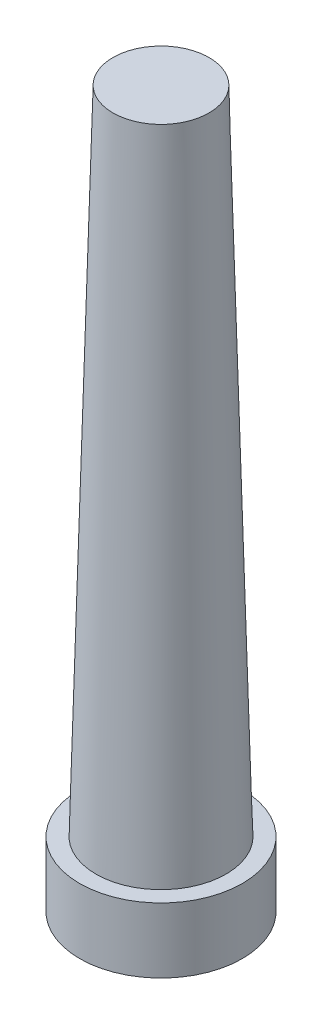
ISO-10303-21;
HEADER;
FILE_DESCRIPTION(('STEP AP214'),'2;1');
FILE_NAME('part.step','',(''),(''),'','','');
FILE_SCHEMA(('AUTOMOTIVE_DESIGN { 1 0 10303 214 1 1 1 1 }'));
ENDSEC;
DATA;
#1=APPLICATION_CONTEXT('core data for automotive mechanical design processes');
#2=APPLICATION_PROTOCOL_DEFINITION('international standard','automotive_design',2000,#1);
#3=PRODUCT_CONTEXT('',#1,'mechanical');
#4=PRODUCT('Part','Part','',(#3));
#5=PRODUCT_RELATED_PRODUCT_CATEGORY('part','',(#4));
#6=PRODUCT_DEFINITION_FORMATION('','',#4);
#7=PRODUCT_DEFINITION_CONTEXT('part definition',#1,'design');
#8=PRODUCT_DEFINITION('design','',#6,#7);
#9=PRODUCT_DEFINITION_SHAPE('','',#8);
#10=(LENGTH_UNIT() NAMED_UNIT(*) SI_UNIT(.MILLI.,.METRE.));
#11=(NAMED_UNIT(*) PLANE_ANGLE_UNIT() SI_UNIT($,.RADIAN.));
#12=(NAMED_UNIT(*) SI_UNIT($,.STERADIAN.) SOLID_ANGLE_UNIT());
#13=UNCERTAINTY_MEASURE_WITH_UNIT(LENGTH_MEASURE(1.E-05),#10,'distance_accuracy_value','');
#14=(GEOMETRIC_REPRESENTATION_CONTEXT(3) GLOBAL_UNCERTAINTY_ASSIGNED_CONTEXT((#13)) GLOBAL_UNIT_ASSIGNED_CONTEXT((#10,
#11,#12)) REPRESENTATION_CONTEXT('',''));
#15=CARTESIAN_POINT('',(0.,0.,0.));
#16=DIRECTION('',(0.,0.,1.));
#17=DIRECTION('',(1.,0.,0.));
#18=AXIS2_PLACEMENT_3D('',#15,#16,#17);
#19=CARTESIAN_POINT('',(0.,100.,0.));
#20=DIRECTION('',(0.,-1.,0.));
#21=DIRECTION('',(0.,0.,-1.));
#22=AXIS2_PLACEMENT_3D('',#19,#20,#21);
#23=CYLINDRICAL_SURFACE('',#22,125.);
#24=CARTESIAN_POINT('',(0.,100.,0.));
#25=DIRECTION('',(0.,1.,0.));
#26=DIRECTION('',(0.,0.,1.));
#27=AXIS2_PLACEMENT_3D('',#24,#25,#26);
#28=CIRCLE('',#27,125.);
#29=CARTESIAN_POINT('',(0.,100.,125.));
#30=VERTEX_POINT('',#29);
#31=EDGE_CURVE('E38',#30,#30,#28,.T.);
#32=ORIENTED_EDGE('',*,*,#31,.F.);
#33=EDGE_LOOP('',(#32));
#34=FACE_BOUND('',#33,.T.);
#35=CARTESIAN_POINT('',(0.,0.,0.));
#36=DIRECTION('',(0.,1.,0.));
#37=DIRECTION('',(0.,0.,1.));
#38=AXIS2_PLACEMENT_3D('',#35,#36,#37);
#39=CIRCLE('',#38,125.);
#40=CARTESIAN_POINT('',(0.,0.,125.));
#41=VERTEX_POINT('',#40);
#42=EDGE_CURVE('E34',#41,#41,#39,.T.);
#43=ORIENTED_EDGE('',*,*,#42,.T.);
#44=EDGE_LOOP('',(#43));
#45=FACE_BOUND('',#44,.T.);
#46=ADVANCED_FACE('F31',(#34,#45),#23,.T.);
#47=CARTESIAN_POINT('',(0.,100.,0.));
#48=DIRECTION('',(0.,1.,0.));
#49=DIRECTION('',(0.,0.,1.));
#50=AXIS2_PLACEMENT_3D('',#47,#48,#49);
#51=PLANE('',#50);
#52=CARTESIAN_POINT('',(0.,100.,0.));
#53=DIRECTION('',(0.,1.,0.));
#54=DIRECTION('',(0.,0.,1.));
#55=AXIS2_PLACEMENT_3D('',#52,#53,#54);
#56=CIRCLE('',#55,100.);
#57=CARTESIAN_POINT('',(0.,100.,100.));
#58=VERTEX_POINT('',#57);
#59=EDGE_CURVE('E10',#58,#58,#56,.T.);
#60=ORIENTED_EDGE('',*,*,#59,.F.);
#61=EDGE_LOOP('',(#60));
#62=FACE_BOUND('',#61,.T.);
#63=ORIENTED_EDGE('',*,*,#31,.T.);
#64=EDGE_LOOP('',(#63));
#65=FACE_BOUND('',#64,.T.);
#66=ADVANCED_FACE('F55',(#62,#65),#51,.T.);
#67=CARTESIAN_POINT('',(0.,0.,0.));
#68=DIRECTION('',(0.,1.,0.));
#69=DIRECTION('',(0.,0.,1.));
#70=AXIS2_PLACEMENT_3D('',#67,#68,#69);
#71=PLANE('',#70);
#72=ORIENTED_EDGE('',*,*,#42,.F.);
#73=EDGE_LOOP('',(#72));
#74=FACE_BOUND('',#73,.T.);
#75=ADVANCED_FACE('F52',(#74),#71,.F.);
#76=CARTESIAN_POINT('',(0.,100.,0.));
#77=DIRECTION('',(0.,-1.,0.));
#78=DIRECTION('',(0.,0.,1.));
#79=AXIS2_PLACEMENT_3D('',#76,#77,#78);
#80=CONICAL_SURFACE('',#79,100.,0.026179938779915);
#81=CARTESIAN_POINT('',(0.,1100.,0.));
#82=DIRECTION('',(0.,1.,0.));
#83=DIRECTION('',(0.,0.,1.));
#84=AXIS2_PLACEMENT_3D('',#81,#82,#83);
#85=CIRCLE('',#84,73.814078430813);
#86=CARTESIAN_POINT('',(0.,1100.,73.814078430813));
#87=VERTEX_POINT('',#86);
#88=EDGE_CURVE('E44',#87,#87,#85,.T.);
#89=ORIENTED_EDGE('',*,*,#88,.F.);
#90=EDGE_LOOP('',(#89));
#91=FACE_BOUND('',#90,.T.);
#92=ORIENTED_EDGE('',*,*,#59,.T.);
#93=EDGE_LOOP('',(#92));
#94=FACE_BOUND('',#93,.T.);
#95=ADVANCED_FACE('F54',(#91,#94),#80,.T.);
#96=CARTESIAN_POINT('',(0.,1100.,0.));
#97=DIRECTION('',(0.,1.,0.));
#98=DIRECTION('',(0.,0.,1.));
#99=AXIS2_PLACEMENT_3D('',#96,#97,#98);
#100=PLANE('',#99);
#101=ORIENTED_EDGE('',*,*,#88,.T.);
#102=EDGE_LOOP('',(#101));
#103=FACE_BOUND('',#102,.T.);
#104=ADVANCED_FACE('F60',(#103),#100,.T.);
#105=CLOSED_SHELL('',(#46,#66,#75,#95,#104));
#106=MANIFOLD_SOLID_BREP('B2',#105);
#107=ADVANCED_BREP_SHAPE_REPRESENTATION('',(#18,#106),#14);
#108=SHAPE_DEFINITION_REPRESENTATION(#9,#107);
ENDSEC;
END-ISO-10303-21;
